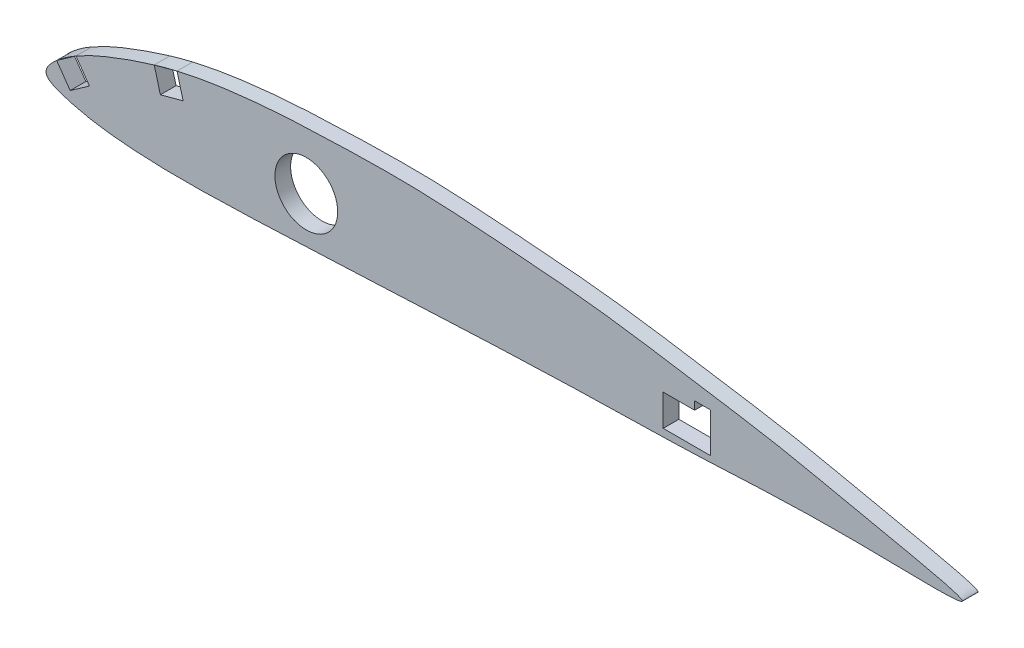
ISO-10303-21;
HEADER;
FILE_DESCRIPTION(('STEP AP214'),'2;1');
FILE_NAME('part.step','',(''),(''),'','','');
FILE_SCHEMA(('AUTOMOTIVE_DESIGN { 1 0 10303 214 1 1 1 1 }'));
ENDSEC;
DATA;
#1=APPLICATION_CONTEXT('core data for automotive mechanical design processes');
#2=APPLICATION_PROTOCOL_DEFINITION('international standard','automotive_design',2000,#1);
#3=PRODUCT_CONTEXT('',#1,'mechanical');
#4=PRODUCT('Part','Part','',(#3));
#5=PRODUCT_RELATED_PRODUCT_CATEGORY('part','',(#4));
#6=PRODUCT_DEFINITION_FORMATION('','',#4);
#7=PRODUCT_DEFINITION_CONTEXT('part definition',#1,'design');
#8=PRODUCT_DEFINITION('design','',#6,#7);
#9=PRODUCT_DEFINITION_SHAPE('','',#8);
#10=(LENGTH_UNIT() NAMED_UNIT(*) SI_UNIT(.MILLI.,.METRE.));
#11=(NAMED_UNIT(*) PLANE_ANGLE_UNIT() SI_UNIT($,.RADIAN.));
#12=(NAMED_UNIT(*) SI_UNIT($,.STERADIAN.) SOLID_ANGLE_UNIT());
#13=UNCERTAINTY_MEASURE_WITH_UNIT(LENGTH_MEASURE(1.E-05),#10,'distance_accuracy_value','');
#14=(GEOMETRIC_REPRESENTATION_CONTEXT(3) GLOBAL_UNCERTAINTY_ASSIGNED_CONTEXT((#13)) GLOBAL_UNIT_ASSIGNED_CONTEXT((#10,
#11,#12)) REPRESENTATION_CONTEXT('',''));
#15=CARTESIAN_POINT('',(0.,0.,0.));
#16=DIRECTION('',(0.,0.,1.));
#17=DIRECTION('',(1.,0.,0.));
#18=AXIS2_PLACEMENT_3D('',#15,#16,#17);
#19=CARTESIAN_POINT('',(0.,0.,0.));
#20=DIRECTION('',(0.,0.,-1.));
#21=DIRECTION('',(-1.,0.,0.));
#22=AXIS2_PLACEMENT_3D('',#19,#20,#21);
#23=PLANE('',#22);
#24=DIRECTION('',(0.,1.,0.));
#25=VECTOR('',#24,1.);
#26=CARTESIAN_POINT('',(131.132,0.,0.));
#27=LINE('',#26,#25);
#28=CARTESIAN_POINT('',(131.132,6.35,0.));
#29=VERTEX_POINT('',#28);
#30=CARTESIAN_POINT('',(131.132,8.,0.));
#31=VERTEX_POINT('',#30);
#32=EDGE_CURVE('E208',#29,#31,#27,.T.);
#33=ORIENTED_EDGE('',*,*,#32,.F.);
#34=DIRECTION('',(1.,0.,0.));
#35=VECTOR('',#34,1.);
#36=CARTESIAN_POINT('',(0.,6.35,0.));
#37=LINE('',#36,#35);
#38=CARTESIAN_POINT('',(124.782,6.35,0.));
#39=VERTEX_POINT('',#38);
#40=EDGE_CURVE('E156',#39,#29,#37,.T.);
#41=ORIENTED_EDGE('',*,*,#40,.F.);
#42=DIRECTION('',(0.,1.,0.));
#43=VECTOR('',#42,1.);
#44=CARTESIAN_POINT('',(124.782,0.,0.));
#45=LINE('',#44,#43);
#46=CARTESIAN_POINT('',(124.782,0.,0.));
#47=VERTEX_POINT('',#46);
#48=EDGE_CURVE('E143',#47,#39,#45,.T.);
#49=ORIENTED_EDGE('',*,*,#48,.F.);
#50=DIRECTION('',(-1.,0.,0.));
#51=VECTOR('',#50,1.);
#52=CARTESIAN_POINT('',(0.,0.,0.));
#53=LINE('',#52,#51);
#54=CARTESIAN_POINT('',(134.307,0.,0.));
#55=VERTEX_POINT('',#54);
#56=EDGE_CURVE('E231',#55,#47,#53,.T.);
#57=ORIENTED_EDGE('',*,*,#56,.F.);
#58=DIRECTION('',(0.,-1.,0.));
#59=VECTOR('',#58,1.);
#60=CARTESIAN_POINT('',(134.307,0.,0.));
#61=LINE('',#60,#59);
#62=CARTESIAN_POINT('',(134.307,8.,0.));
#63=VERTEX_POINT('',#62);
#64=EDGE_CURVE('E227',#63,#55,#61,.T.);
#65=ORIENTED_EDGE('',*,*,#64,.F.);
#66=DIRECTION('',(1.,0.,0.));
#67=VECTOR('',#66,1.);
#68=CARTESIAN_POINT('',(0.,8.,0.));
#69=LINE('',#68,#67);
#70=EDGE_CURVE('E164',#31,#63,#69,.T.);
#71=ORIENTED_EDGE('',*,*,#70,.F.);
#72=EDGE_LOOP('',(#33,#41,#49,#57,#65,#71));
#73=FACE_BOUND('',#72,.T.);
#74=DIRECTION('',(-0.573576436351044,0.819152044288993,0.));
#75=VECTOR('',#74,1.);
#76=CARTESIAN_POINT('',(2.90598321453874,2.0347913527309,0.));
#77=LINE('',#76,#75);
#78=CARTESIAN_POINT('',(4.88912991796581,-0.797435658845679,0.));
#79=VERTEX_POINT('',#78);
#80=CARTESIAN_POINT('',(2.15747213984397,3.10377595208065,0.));
#81=VERTEX_POINT('',#80);
#82=EDGE_CURVE('E170',#79,#81,#77,.T.);
#83=ORIENTED_EDGE('',*,*,#82,.F.);
#84=DIRECTION('',(-0.819152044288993,-0.573576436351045,0.));
#85=VECTOR('',#84,1.);
#86=CARTESIAN_POINT('',(1.98314670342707,-2.83222701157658,0.));
#87=LINE('',#86,#85);
#88=CARTESIAN_POINT('',(8.79034152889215,1.93422211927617,0.));
#89=VERTEX_POINT('',#88);
#90=EDGE_CURVE('E235',#89,#79,#87,.T.);
#91=ORIENTED_EDGE('',*,*,#90,.F.);
#92=DIRECTION('',(0.573576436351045,-0.819152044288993,0.));
#93=VECTOR('',#92,1.);
#94=CARTESIAN_POINT('',(6.80719482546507,4.76644913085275,0.));
#95=LINE('',#94,#93);
#96=CARTESIAN_POINT('',(6.0586837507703,5.8354337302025,0.));
#97=VERTEX_POINT('',#96);
#98=EDGE_CURVE('E245',#97,#89,#95,.T.);
#99=ORIENTED_EDGE('',*,*,#98,.F.);
#100=CARTESIAN_POINT('',(0.,0.,0.));
#101=CARTESIAN_POINT('',(-0.0510371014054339,0.99111435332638,0.));
#102=CARTESIAN_POINT('',(2.11317193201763,3.21598034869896,0.));
#103=CARTESIAN_POINT('',(5.18701691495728,5.41749188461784,0.));
#104=CARTESIAN_POINT('',(9.1709488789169,7.56280277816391,0.));
#105=CARTESIAN_POINT('',(16.8003247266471,10.6662158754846,0.));
#106=CARTESIAN_POINT('',(26.0552091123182,13.6190284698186,0.));
#107=CARTESIAN_POINT('',(37.0103739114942,15.3709529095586,0.));
#108=CARTESIAN_POINT('',(46.2955117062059,16.2975785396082,0.));
#109=CARTESIAN_POINT('',(58.6549387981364,16.8155629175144,0.));
#110=CARTESIAN_POINT('',(74.1197721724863,17.2541897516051,0.));
#111=CARTESIAN_POINT('',(92.6289873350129,15.9551342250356,0.));
#112=CARTESIAN_POINT('',(111.271837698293,14.5024851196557,0.));
#113=CARTESIAN_POINT('',(129.491666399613,11.5838077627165,0.));
#114=CARTESIAN_POINT('',(149.036614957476,8.59586396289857,0.));
#115=CARTESIAN_POINT('',(163.952601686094,5.08680195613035,0.));
#116=CARTESIAN_POINT('',(195.703926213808,-1.20255975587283,0.));
#117=CARTESIAN_POINT('',(154.620961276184,0.244480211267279,0.));
#118=CARTESIAN_POINT('',(136.754951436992,-1.39054378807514,0.));
#119=CARTESIAN_POINT('',(98.1870529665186,-1.99852366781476,0.));
#120=CARTESIAN_POINT('',(68.0386567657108,-3.64127589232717,0.));
#121=CARTESIAN_POINT('',(36.9982035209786,-4.99429997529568,0.));
#122=CARTESIAN_POINT('',(21.7434792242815,-5.24443451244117,0.));
#123=CARTESIAN_POINT('',(10.5152616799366,-4.15694764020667,0.));
#124=CARTESIAN_POINT('',(4.79914448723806,-2.84996151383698,0.));
#125=CARTESIAN_POINT('',(0.0700361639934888,-1.36006641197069,0.));
#126=CARTESIAN_POINT('',(0.,0.,0.));
#127=B_SPLINE_CURVE_WITH_KNOTS('',3,(#100,#101,#102,#103,#104,#105,#106,#107,#108,#109,#110,
#111,#112,#113,#114,#115,#116,#117,#118,#119,#120,#121,#122,#123,#124,#125,#126),.UNSPECIFIED.,
.T.,.F.,(4,1,1,1,1,1,1,1,1,1,1,1,1,1,1,1,1,1,1,1,1,1,1,1,4),(0.,0.0105604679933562,
0.0182111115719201,0.0322098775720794,0.0455249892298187,0.0840694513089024,0.10897429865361,
0.133649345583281,0.158232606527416,0.207343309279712,0.25652270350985,0.30582635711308,
0.355445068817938,0.40521420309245,0.4553904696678,0.506006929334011,0.555121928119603,
0.653369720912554,0.702490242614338,0.849938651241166,0.899083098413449,0.948194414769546,
0.972905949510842,0.985508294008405,1.),.UNSPECIFIED.);
#128=CARTESIAN_POINT('',(21.8877922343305,12.1770810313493,0.));
#129=VERTEX_POINT('',#128);
#130=EDGE_CURVE('E183',#97,#129,#127,.T.);
#131=ORIENTED_EDGE('',*,*,#130,.T.);
#132=DIRECTION('',(-0.258819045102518,0.965925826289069,0.));
#133=VECTOR('',#132,1.);
#134=CARTESIAN_POINT('',(23.4658584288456,6.28765781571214,0.));
#135=LINE('',#134,#133);
#136=CARTESIAN_POINT('',(23.1204179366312,7.57685928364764,0.));
#137=VERTEX_POINT('',#136);
#138=EDGE_CURVE('E219',#137,#129,#135,.T.);
#139=ORIENTED_EDGE('',*,*,#138,.F.);
#140=DIRECTION('',(-0.965925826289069,-0.258819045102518,0.));
#141=VECTOR('',#140,1.);
#142=CARTESIAN_POINT('',(-0.345440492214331,1.2892014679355,0.));
#143=LINE('',#142,#141);
#144=CARTESIAN_POINT('',(27.7206396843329,8.80948498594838,0.));
#145=VERTEX_POINT('',#144);
#146=EDGE_CURVE('E239',#145,#137,#143,.T.);
#147=ORIENTED_EDGE('',*,*,#146,.F.);
#148=DIRECTION('',(0.258819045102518,-0.965925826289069,0.));
#149=VECTOR('',#148,1.);
#150=CARTESIAN_POINT('',(28.0660801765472,7.52028351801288,0.));
#151=LINE('',#150,#149);
#152=CARTESIAN_POINT('',(26.4880139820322,13.4097067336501,0.));
#153=VERTEX_POINT('',#152);
#154=EDGE_CURVE('E249',#153,#145,#151,.T.);
#155=ORIENTED_EDGE('',*,*,#154,.F.);
#156=EDGE_CURVE('E176',#153,#81,#127,.T.);
#157=ORIENTED_EDGE('',*,*,#156,.T.);
#158=EDGE_LOOP('',(#83,#91,#99,#131,#139,#147,#155,#157));
#159=FACE_BOUND('',#158,.T.);
#160=CARTESIAN_POINT('',(52.625,4.99999999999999,0.));
#161=DIRECTION('',(0.,0.,-1.));
#162=DIRECTION('',(-1.,0.,0.));
#163=AXIS2_PLACEMENT_3D('',#160,#161,#162);
#164=CIRCLE('',#163,6.35);
#165=CARTESIAN_POINT('',(46.275,4.99999999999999,0.));
#166=VERTEX_POINT('',#165);
#167=EDGE_CURVE('E214',#166,#166,#164,.T.);
#168=ORIENTED_EDGE('',*,*,#167,.F.);
#169=EDGE_LOOP('',(#168));
#170=FACE_BOUND('',#169,.T.);
#171=ADVANCED_FACE('F44',(#73,#159,#170),#23,.T.);
#172=CARTESIAN_POINT('',(0.,0.,3.175));
#173=DIRECTION('',(0.,0.,-1.));
#174=DIRECTION('',(-1.,0.,0.));
#175=AXIS2_PLACEMENT_3D('',#172,#173,#174);
#176=PLANE('',#175);
#177=DIRECTION('',(-1.,0.,0.));
#178=VECTOR('',#177,1.);
#179=CARTESIAN_POINT('',(124.782,6.35,3.175));
#180=LINE('',#179,#178);
#181=CARTESIAN_POINT('',(131.132,6.35,3.175));
#182=VERTEX_POINT('',#181);
#183=CARTESIAN_POINT('',(124.782,6.35,3.175));
#184=VERTEX_POINT('',#183);
#185=EDGE_CURVE('E13',#182,#184,#180,.T.);
#186=ORIENTED_EDGE('',*,*,#185,.F.);
#187=DIRECTION('',(0.,-1.,0.));
#188=VECTOR('',#187,1.);
#189=CARTESIAN_POINT('',(131.132,8.,3.175));
#190=LINE('',#189,#188);
#191=CARTESIAN_POINT('',(131.132,8.,3.175));
#192=VERTEX_POINT('',#191);
#193=EDGE_CURVE('E162',#192,#182,#190,.T.);
#194=ORIENTED_EDGE('',*,*,#193,.F.);
#195=DIRECTION('',(-1.,0.,0.));
#196=VECTOR('',#195,1.);
#197=CARTESIAN_POINT('',(131.132,8.,3.175));
#198=LINE('',#197,#196);
#199=CARTESIAN_POINT('',(134.307,8.,3.175));
#200=VERTEX_POINT('',#199);
#201=EDGE_CURVE('E230',#200,#192,#198,.T.);
#202=ORIENTED_EDGE('',*,*,#201,.F.);
#203=DIRECTION('',(0.,1.,0.));
#204=VECTOR('',#203,1.);
#205=CARTESIAN_POINT('',(134.307,8.,3.175));
#206=LINE('',#205,#204);
#207=CARTESIAN_POINT('',(134.307,0.,3.175));
#208=VERTEX_POINT('',#207);
#209=EDGE_CURVE('E233',#208,#200,#206,.T.);
#210=ORIENTED_EDGE('',*,*,#209,.F.);
#211=DIRECTION('',(1.,0.,0.));
#212=VECTOR('',#211,1.);
#213=CARTESIAN_POINT('',(131.132,0.,3.175));
#214=LINE('',#213,#212);
#215=CARTESIAN_POINT('',(124.782,0.,3.175));
#216=VERTEX_POINT('',#215);
#217=EDGE_CURVE('E155',#216,#208,#214,.T.);
#218=ORIENTED_EDGE('',*,*,#217,.F.);
#219=DIRECTION('',(0.,-1.,0.));
#220=VECTOR('',#219,1.);
#221=CARTESIAN_POINT('',(124.782,6.35,3.175));
#222=LINE('',#221,#220);
#223=EDGE_CURVE('E140',#184,#216,#222,.T.);
#224=ORIENTED_EDGE('',*,*,#223,.F.);
#225=EDGE_LOOP('',(#186,#194,#202,#210,#218,#224));
#226=FACE_BOUND('',#225,.T.);
#227=CARTESIAN_POINT('',(52.625,4.99999999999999,3.175));
#228=DIRECTION('',(0.,0.,1.));
#229=DIRECTION('',(1.,0.,0.));
#230=AXIS2_PLACEMENT_3D('',#227,#228,#229);
#231=CIRCLE('',#230,6.35);
#232=CARTESIAN_POINT('',(58.975,4.99999999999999,3.175));
#233=VERTEX_POINT('',#232);
#234=EDGE_CURVE('E216',#233,#233,#231,.T.);
#235=ORIENTED_EDGE('',*,*,#234,.F.);
#236=EDGE_LOOP('',(#235));
#237=FACE_BOUND('',#236,.T.);
#238=DIRECTION('',(0.819152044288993,0.573576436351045,0.));
#239=VECTOR('',#238,1.);
#240=CARTESIAN_POINT('',(4.88912991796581,-0.797435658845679,3.175));
#241=LINE('',#240,#239);
#242=CARTESIAN_POINT('',(4.88912991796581,-0.797435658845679,3.175));
#243=VERTEX_POINT('',#242);
#244=CARTESIAN_POINT('',(8.79034152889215,1.93422211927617,3.175));
#245=VERTEX_POINT('',#244);
#246=EDGE_CURVE('E224',#243,#245,#241,.T.);
#247=ORIENTED_EDGE('',*,*,#246,.F.);
#248=DIRECTION('',(0.573576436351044,-0.819152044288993,0.));
#249=VECTOR('',#248,1.);
#250=CARTESIAN_POINT('',(2.15747213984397,3.10377595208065,3.175));
#251=LINE('',#250,#249);
#252=CARTESIAN_POINT('',(2.15747213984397,3.10377595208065,3.175));
#253=VERTEX_POINT('',#252);
#254=EDGE_CURVE('E169',#253,#243,#251,.T.);
#255=ORIENTED_EDGE('',*,*,#254,.F.);
#256=CARTESIAN_POINT('',(0.,0.,3.175));
#257=CARTESIAN_POINT('',(-0.0510371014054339,0.99111435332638,3.175));
#258=CARTESIAN_POINT('',(2.11317193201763,3.21598034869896,3.175));
#259=CARTESIAN_POINT('',(5.18701691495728,5.41749188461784,3.175));
#260=CARTESIAN_POINT('',(9.1709488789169,7.56280277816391,3.175));
#261=CARTESIAN_POINT('',(16.8003247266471,10.6662158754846,3.175));
#262=CARTESIAN_POINT('',(26.0552091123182,13.6190284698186,3.175));
#263=CARTESIAN_POINT('',(37.0103739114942,15.3709529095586,3.175));
#264=CARTESIAN_POINT('',(46.2955117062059,16.2975785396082,3.175));
#265=CARTESIAN_POINT('',(58.6549387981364,16.8155629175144,3.175));
#266=CARTESIAN_POINT('',(74.1197721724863,17.2541897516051,3.175));
#267=CARTESIAN_POINT('',(92.6289873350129,15.9551342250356,3.175));
#268=CARTESIAN_POINT('',(111.271837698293,14.5024851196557,3.175));
#269=CARTESIAN_POINT('',(129.491666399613,11.5838077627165,3.175));
#270=CARTESIAN_POINT('',(149.036614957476,8.59586396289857,3.175));
#271=CARTESIAN_POINT('',(163.952601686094,5.08680195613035,3.175));
#272=CARTESIAN_POINT('',(195.703926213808,-1.20255975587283,3.175));
#273=CARTESIAN_POINT('',(154.620961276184,0.244480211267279,3.175));
#274=CARTESIAN_POINT('',(136.754951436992,-1.39054378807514,3.175));
#275=CARTESIAN_POINT('',(98.1870529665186,-1.99852366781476,3.175));
#276=CARTESIAN_POINT('',(68.0386567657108,-3.64127589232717,3.175));
#277=CARTESIAN_POINT('',(36.9982035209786,-4.99429997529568,3.175));
#278=CARTESIAN_POINT('',(21.7434792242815,-5.24443451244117,3.175));
#279=CARTESIAN_POINT('',(10.5152616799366,-4.15694764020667,3.175));
#280=CARTESIAN_POINT('',(4.79914448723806,-2.84996151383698,3.175));
#281=CARTESIAN_POINT('',(0.0700361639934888,-1.36006641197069,3.175));
#282=CARTESIAN_POINT('',(0.,0.,3.175));
#283=B_SPLINE_CURVE_WITH_KNOTS('',3,(#256,#257,#258,#259,#260,#261,#262,#263,#264,#265,#266,
#267,#268,#269,#270,#271,#272,#273,#274,#275,#276,#277,#278,#279,#280,#281,#282),.UNSPECIFIED.,
.T.,.F.,(4,1,1,1,1,1,1,1,1,1,1,1,1,1,1,1,1,1,1,1,1,1,1,1,4),(0.,0.0105604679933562,
0.0182111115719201,0.0322098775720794,0.0455249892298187,0.0840694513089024,0.10897429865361,
0.133649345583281,0.158232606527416,0.207343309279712,0.25652270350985,0.30582635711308,
0.355445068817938,0.40521420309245,0.4553904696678,0.506006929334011,0.555121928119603,
0.653369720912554,0.702490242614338,0.849938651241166,0.899083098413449,0.948194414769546,
0.972905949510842,0.985508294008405,1.),.UNSPECIFIED.);
#284=CARTESIAN_POINT('',(26.4880139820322,13.4097067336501,3.175));
#285=VERTEX_POINT('',#284);
#286=EDGE_CURVE('E175',#285,#253,#283,.T.);
#287=ORIENTED_EDGE('',*,*,#286,.F.);
#288=DIRECTION('',(-0.258819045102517,0.965925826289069,0.));
#289=VECTOR('',#288,1.);
#290=CARTESIAN_POINT('',(26.4880139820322,13.4097067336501,3.175));
#291=LINE('',#290,#289);
#292=CARTESIAN_POINT('',(27.7206396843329,8.80948498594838,3.175));
#293=VERTEX_POINT('',#292);
#294=EDGE_CURVE('E242',#293,#285,#291,.T.);
#295=ORIENTED_EDGE('',*,*,#294,.F.);
#296=DIRECTION('',(0.965925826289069,0.258819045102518,0.));
#297=VECTOR('',#296,1.);
#298=CARTESIAN_POINT('',(23.1204179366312,7.57685928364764,3.175));
#299=LINE('',#298,#297);
#300=CARTESIAN_POINT('',(23.1204179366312,7.57685928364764,3.175));
#301=VERTEX_POINT('',#300);
#302=EDGE_CURVE('E244',#301,#293,#299,.T.);
#303=ORIENTED_EDGE('',*,*,#302,.F.);
#304=DIRECTION('',(0.258819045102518,-0.965925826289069,0.));
#305=VECTOR('',#304,1.);
#306=CARTESIAN_POINT('',(21.8877922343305,12.1770810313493,3.175));
#307=LINE('',#306,#305);
#308=CARTESIAN_POINT('',(21.8877922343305,12.1770810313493,3.175));
#309=VERTEX_POINT('',#308);
#310=EDGE_CURVE('E252',#309,#301,#307,.T.);
#311=ORIENTED_EDGE('',*,*,#310,.F.);
#312=CARTESIAN_POINT('',(6.0586837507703,5.8354337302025,3.175));
#313=VERTEX_POINT('',#312);
#314=EDGE_CURVE('E174',#313,#309,#283,.T.);
#315=ORIENTED_EDGE('',*,*,#314,.F.);
#316=DIRECTION('',(-0.573576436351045,0.819152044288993,0.));
#317=VECTOR('',#316,1.);
#318=CARTESIAN_POINT('',(6.0586837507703,5.8354337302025,3.175));
#319=LINE('',#318,#317);
#320=EDGE_CURVE('E238',#245,#313,#319,.T.);
#321=ORIENTED_EDGE('',*,*,#320,.F.);
#322=EDGE_LOOP('',(#247,#255,#287,#295,#303,#311,#315,#321));
#323=FACE_BOUND('',#322,.T.);
#324=ADVANCED_FACE('F152',(#226,#237,#323),#176,.F.);
#325=DIRECTION('',(0.,0.,1.));
#326=VECTOR('',#325,1.);
#327=SURFACE_OF_LINEAR_EXTRUSION('',#127,#326);
#328=DIRECTION('',(0.,0.,1.));
#329=VECTOR('',#328,1.);
#330=CARTESIAN_POINT('',(2.1574721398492,3.10377595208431,0.));
#331=LINE('',#330,#329);
#332=EDGE_CURVE('E166',#81,#253,#331,.T.);
#333=ORIENTED_EDGE('',*,*,#332,.F.);
#334=ORIENTED_EDGE('',*,*,#156,.F.);
#335=DIRECTION('',(0.,0.,1.));
#336=VECTOR('',#335,1.);
#337=CARTESIAN_POINT('',(26.4880139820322,13.4097067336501,0.));
#338=LINE('',#337,#336);
#339=EDGE_CURVE('E182',#153,#285,#338,.T.);
#340=ORIENTED_EDGE('',*,*,#339,.T.);
#341=ORIENTED_EDGE('',*,*,#286,.T.);
#342=EDGE_LOOP('',(#333,#334,#340,#341));
#343=FACE_BOUND('',#342,.T.);
#344=ADVANCED_FACE('F192',(#343),#327,.F.);
#345=ORIENTED_EDGE('',*,*,#130,.F.);
#346=DIRECTION('',(0.,0.,1.));
#347=VECTOR('',#346,1.);
#348=CARTESIAN_POINT('',(6.05868375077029,5.8354337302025,0.));
#349=LINE('',#348,#347);
#350=EDGE_CURVE('E171',#97,#313,#349,.T.);
#351=ORIENTED_EDGE('',*,*,#350,.T.);
#352=ORIENTED_EDGE('',*,*,#314,.T.);
#353=DIRECTION('',(0.,0.,1.));
#354=VECTOR('',#353,1.);
#355=CARTESIAN_POINT('',(21.8877922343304,12.1770810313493,0.));
#356=LINE('',#355,#354);
#357=EDGE_CURVE('E47',#129,#309,#356,.T.);
#358=ORIENTED_EDGE('',*,*,#357,.F.);
#359=EDGE_LOOP('',(#345,#351,#352,#358));
#360=FACE_BOUND('',#359,.T.);
#361=ADVANCED_FACE('F188',(#360),#327,.F.);
#362=CARTESIAN_POINT('',(52.625,4.99999999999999,-6.825));
#363=DIRECTION('',(0.,0.,1.));
#364=DIRECTION('',(1.,0.,0.));
#365=AXIS2_PLACEMENT_3D('',#362,#363,#364);
#366=CYLINDRICAL_SURFACE('',#365,6.35);
#367=ORIENTED_EDGE('',*,*,#167,.T.);
#368=EDGE_LOOP('',(#367));
#369=FACE_BOUND('',#368,.T.);
#370=ORIENTED_EDGE('',*,*,#234,.T.);
#371=EDGE_LOOP('',(#370));
#372=FACE_BOUND('',#371,.T.);
#373=ADVANCED_FACE('F191',(#369,#372),#366,.F.);
#374=CARTESIAN_POINT('',(21.8877922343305,12.1770810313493,-6.825));
#375=DIRECTION('',(-0.965925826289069,-0.258819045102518,0.));
#376=DIRECTION('',(0.258819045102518,-0.965925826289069,0.));
#377=AXIS2_PLACEMENT_3D('',#374,#375,#376);
#378=PLANE('',#377);
#379=ORIENTED_EDGE('',*,*,#138,.T.);
#380=ORIENTED_EDGE('',*,*,#357,.T.);
#381=ORIENTED_EDGE('',*,*,#310,.T.);
#382=DIRECTION('',(0.,0.,1.));
#383=VECTOR('',#382,1.);
#384=CARTESIAN_POINT('',(23.1204179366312,7.57685928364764,-6.825));
#385=LINE('',#384,#383);
#386=EDGE_CURVE('E241',#137,#301,#385,.T.);
#387=ORIENTED_EDGE('',*,*,#386,.F.);
#388=EDGE_LOOP('',(#379,#380,#381,#387));
#389=FACE_BOUND('',#388,.T.);
#390=ADVANCED_FACE('F378',(#389),#378,.F.);
#391=CARTESIAN_POINT('',(26.4880139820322,13.4097067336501,-6.825));
#392=DIRECTION('',(0.965925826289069,0.258819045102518,0.));
#393=DIRECTION('',(-0.258819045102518,0.965925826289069,0.));
#394=AXIS2_PLACEMENT_3D('',#391,#392,#393);
#395=PLANE('',#394);
#396=ORIENTED_EDGE('',*,*,#154,.T.);
#397=DIRECTION('',(0.,0.,1.));
#398=VECTOR('',#397,1.);
#399=CARTESIAN_POINT('',(27.7206396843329,8.80948498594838,-6.825));
#400=LINE('',#399,#398);
#401=EDGE_CURVE('E251',#145,#293,#400,.T.);
#402=ORIENTED_EDGE('',*,*,#401,.T.);
#403=ORIENTED_EDGE('',*,*,#294,.T.);
#404=ORIENTED_EDGE('',*,*,#339,.F.);
#405=EDGE_LOOP('',(#396,#402,#403,#404));
#406=FACE_BOUND('',#405,.T.);
#407=ADVANCED_FACE('F369',(#406),#395,.F.);
#408=CARTESIAN_POINT('',(23.1204179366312,7.57685928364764,-6.825));
#409=DIRECTION('',(0.258819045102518,-0.965925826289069,0.));
#410=DIRECTION('',(0.965925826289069,0.258819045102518,0.));
#411=AXIS2_PLACEMENT_3D('',#408,#409,#410);
#412=PLANE('',#411);
#413=ORIENTED_EDGE('',*,*,#146,.T.);
#414=ORIENTED_EDGE('',*,*,#386,.T.);
#415=ORIENTED_EDGE('',*,*,#302,.T.);
#416=ORIENTED_EDGE('',*,*,#401,.F.);
#417=EDGE_LOOP('',(#413,#414,#415,#416));
#418=FACE_BOUND('',#417,.T.);
#419=ADVANCED_FACE('F360',(#418),#412,.F.);
#420=CARTESIAN_POINT('',(2.15747213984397,3.10377595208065,-6.825));
#421=DIRECTION('',(-0.819152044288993,-0.573576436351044,0.));
#422=DIRECTION('',(0.573576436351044,-0.819152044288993,0.));
#423=AXIS2_PLACEMENT_3D('',#420,#421,#422);
#424=PLANE('',#423);
#425=ORIENTED_EDGE('',*,*,#82,.T.);
#426=ORIENTED_EDGE('',*,*,#332,.T.);
#427=ORIENTED_EDGE('',*,*,#254,.T.);
#428=DIRECTION('',(0.,0.,1.));
#429=VECTOR('',#428,1.);
#430=CARTESIAN_POINT('',(4.88912991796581,-0.797435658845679,-6.825));
#431=LINE('',#430,#429);
#432=EDGE_CURVE('E237',#79,#243,#431,.T.);
#433=ORIENTED_EDGE('',*,*,#432,.F.);
#434=EDGE_LOOP('',(#425,#426,#427,#433));
#435=FACE_BOUND('',#434,.T.);
#436=ADVANCED_FACE('F352',(#435),#424,.F.);
#437=CARTESIAN_POINT('',(6.0586837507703,5.8354337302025,-6.825));
#438=DIRECTION('',(0.819152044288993,0.573576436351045,0.));
#439=DIRECTION('',(-0.573576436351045,0.819152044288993,0.));
#440=AXIS2_PLACEMENT_3D('',#437,#438,#439);
#441=PLANE('',#440);
#442=ORIENTED_EDGE('',*,*,#98,.T.);
#443=DIRECTION('',(0.,0.,1.));
#444=VECTOR('',#443,1.);
#445=CARTESIAN_POINT('',(8.79034152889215,1.93422211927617,-6.825));
#446=LINE('',#445,#444);
#447=EDGE_CURVE('E247',#89,#245,#446,.T.);
#448=ORIENTED_EDGE('',*,*,#447,.T.);
#449=ORIENTED_EDGE('',*,*,#320,.T.);
#450=ORIENTED_EDGE('',*,*,#350,.F.);
#451=EDGE_LOOP('',(#442,#448,#449,#450));
#452=FACE_BOUND('',#451,.T.);
#453=ADVANCED_FACE('F293',(#452),#441,.F.);
#454=CARTESIAN_POINT('',(4.88912991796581,-0.797435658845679,-6.825));
#455=DIRECTION('',(0.573576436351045,-0.819152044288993,0.));
#456=DIRECTION('',(0.819152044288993,0.573576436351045,0.));
#457=AXIS2_PLACEMENT_3D('',#454,#455,#456);
#458=PLANE('',#457);
#459=ORIENTED_EDGE('',*,*,#90,.T.);
#460=ORIENTED_EDGE('',*,*,#432,.T.);
#461=ORIENTED_EDGE('',*,*,#246,.T.);
#462=ORIENTED_EDGE('',*,*,#447,.F.);
#463=EDGE_LOOP('',(#459,#460,#461,#462));
#464=FACE_BOUND('',#463,.T.);
#465=ADVANCED_FACE('F287',(#464),#458,.F.);
#466=CARTESIAN_POINT('',(131.132,8.,-6.825));
#467=DIRECTION('',(-1.,0.,0.));
#468=DIRECTION('',(0.,0.,1.));
#469=AXIS2_PLACEMENT_3D('',#466,#467,#468);
#470=PLANE('',#469);
#471=ORIENTED_EDGE('',*,*,#32,.T.);
#472=DIRECTION('',(0.,0.,1.));
#473=VECTOR('',#472,1.);
#474=CARTESIAN_POINT('',(131.132,8.,-6.825));
#475=LINE('',#474,#473);
#476=EDGE_CURVE('E165',#31,#192,#475,.T.);
#477=ORIENTED_EDGE('',*,*,#476,.T.);
#478=ORIENTED_EDGE('',*,*,#193,.T.);
#479=DIRECTION('',(0.,0.,1.));
#480=VECTOR('',#479,1.);
#481=CARTESIAN_POINT('',(131.132,6.35,-6.825));
#482=LINE('',#481,#480);
#483=EDGE_CURVE('E53',#29,#182,#482,.T.);
#484=ORIENTED_EDGE('',*,*,#483,.F.);
#485=EDGE_LOOP('',(#471,#477,#478,#484));
#486=FACE_BOUND('',#485,.T.);
#487=ADVANCED_FACE('F285',(#486),#470,.F.);
#488=CARTESIAN_POINT('',(131.132,8.,-6.825));
#489=DIRECTION('',(0.,1.,0.));
#490=DIRECTION('',(0.,0.,1.));
#491=AXIS2_PLACEMENT_3D('',#488,#489,#490);
#492=PLANE('',#491);
#493=ORIENTED_EDGE('',*,*,#70,.T.);
#494=DIRECTION('',(0.,0.,1.));
#495=VECTOR('',#494,1.);
#496=CARTESIAN_POINT('',(134.307,8.,-6.825));
#497=LINE('',#496,#495);
#498=EDGE_CURVE('E226',#63,#200,#497,.T.);
#499=ORIENTED_EDGE('',*,*,#498,.T.);
#500=ORIENTED_EDGE('',*,*,#201,.T.);
#501=ORIENTED_EDGE('',*,*,#476,.F.);
#502=EDGE_LOOP('',(#493,#499,#500,#501));
#503=FACE_BOUND('',#502,.T.);
#504=ADVANCED_FACE('F194',(#503),#492,.F.);
#505=CARTESIAN_POINT('',(134.307,8.,-6.825));
#506=DIRECTION('',(1.,0.,0.));
#507=DIRECTION('',(0.,0.,-1.));
#508=AXIS2_PLACEMENT_3D('',#505,#506,#507);
#509=PLANE('',#508);
#510=ORIENTED_EDGE('',*,*,#64,.T.);
#511=DIRECTION('',(0.,0.,1.));
#512=VECTOR('',#511,1.);
#513=CARTESIAN_POINT('',(134.307,0.,-6.825));
#514=LINE('',#513,#512);
#515=EDGE_CURVE('E229',#55,#208,#514,.T.);
#516=ORIENTED_EDGE('',*,*,#515,.T.);
#517=ORIENTED_EDGE('',*,*,#209,.T.);
#518=ORIENTED_EDGE('',*,*,#498,.F.);
#519=EDGE_LOOP('',(#510,#516,#517,#518));
#520=FACE_BOUND('',#519,.T.);
#521=ADVANCED_FACE('F277',(#520),#509,.F.);
#522=CARTESIAN_POINT('',(131.132,0.,-6.825));
#523=DIRECTION('',(0.,-1.,0.));
#524=DIRECTION('',(0.,0.,-1.));
#525=AXIS2_PLACEMENT_3D('',#522,#523,#524);
#526=PLANE('',#525);
#527=ORIENTED_EDGE('',*,*,#56,.T.);
#528=DIRECTION('',(0.,0.,1.));
#529=VECTOR('',#528,1.);
#530=CARTESIAN_POINT('',(124.782,0.,-6.825));
#531=LINE('',#530,#529);
#532=EDGE_CURVE('E135',#47,#216,#531,.T.);
#533=ORIENTED_EDGE('',*,*,#532,.T.);
#534=ORIENTED_EDGE('',*,*,#217,.T.);
#535=ORIENTED_EDGE('',*,*,#515,.F.);
#536=EDGE_LOOP('',(#527,#533,#534,#535));
#537=FACE_BOUND('',#536,.T.);
#538=ADVANCED_FACE('F283',(#537),#526,.F.);
#539=CARTESIAN_POINT('',(124.782,6.35,-6.825));
#540=DIRECTION('',(-1.,0.,0.));
#541=DIRECTION('',(0.,0.,1.));
#542=AXIS2_PLACEMENT_3D('',#539,#540,#541);
#543=PLANE('',#542);
#544=ORIENTED_EDGE('',*,*,#48,.T.);
#545=DIRECTION('',(0.,0.,1.));
#546=VECTOR('',#545,1.);
#547=CARTESIAN_POINT('',(124.782,6.35,-6.825));
#548=LINE('',#547,#546);
#549=EDGE_CURVE('E61',#39,#184,#548,.T.);
#550=ORIENTED_EDGE('',*,*,#549,.T.);
#551=ORIENTED_EDGE('',*,*,#223,.T.);
#552=ORIENTED_EDGE('',*,*,#532,.F.);
#553=EDGE_LOOP('',(#544,#550,#551,#552));
#554=FACE_BOUND('',#553,.T.);
#555=ADVANCED_FACE('F138',(#554),#543,.F.);
#556=CARTESIAN_POINT('',(124.782,6.35,-6.825));
#557=DIRECTION('',(0.,1.,0.));
#558=DIRECTION('',(0.,0.,1.));
#559=AXIS2_PLACEMENT_3D('',#556,#557,#558);
#560=PLANE('',#559);
#561=ORIENTED_EDGE('',*,*,#40,.T.);
#562=ORIENTED_EDGE('',*,*,#483,.T.);
#563=ORIENTED_EDGE('',*,*,#185,.T.);
#564=ORIENTED_EDGE('',*,*,#549,.F.);
#565=EDGE_LOOP('',(#561,#562,#563,#564));
#566=FACE_BOUND('',#565,.T.);
#567=ADVANCED_FACE('F148',(#566),#560,.F.);
#568=CLOSED_SHELL('',(#171,#324,#344,#361,#373,#390,#407,#419,#436,#453,#465,#487,#504,#521,
#538,#555,#567));
#569=MANIFOLD_SOLID_BREP('B2',#568);
#570=CARTESIAN_POINT('',(0.,0.,0.));
#571=CARTESIAN_POINT('',(-0.0510371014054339,0.99111435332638,0.));
#572=CARTESIAN_POINT('',(2.11317193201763,3.21598034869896,0.));
#573=CARTESIAN_POINT('',(5.18701691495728,5.41749188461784,0.));
#574=CARTESIAN_POINT('',(9.1709488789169,7.56280277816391,0.));
#575=CARTESIAN_POINT('',(16.8003247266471,10.6662158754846,0.));
#576=CARTESIAN_POINT('',(26.0552091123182,13.6190284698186,0.));
#577=CARTESIAN_POINT('',(37.0103739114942,15.3709529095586,0.));
#578=CARTESIAN_POINT('',(46.2955117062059,16.2975785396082,0.));
#579=CARTESIAN_POINT('',(58.6549387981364,16.8155629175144,0.));
#580=CARTESIAN_POINT('',(74.1197721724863,17.2541897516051,0.));
#581=CARTESIAN_POINT('',(92.6289873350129,15.9551342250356,0.));
#582=CARTESIAN_POINT('',(111.271837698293,14.5024851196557,0.));
#583=CARTESIAN_POINT('',(129.491666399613,11.5838077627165,0.));
#584=CARTESIAN_POINT('',(149.036614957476,8.59586396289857,0.));
#585=CARTESIAN_POINT('',(163.952601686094,5.08680195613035,0.));
#586=CARTESIAN_POINT('',(195.703926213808,-1.20255975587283,0.));
#587=CARTESIAN_POINT('',(154.620961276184,0.244480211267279,0.));
#588=CARTESIAN_POINT('',(136.754951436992,-1.39054378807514,0.));
#589=CARTESIAN_POINT('',(98.1870529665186,-1.99852366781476,0.));
#590=CARTESIAN_POINT('',(68.0386567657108,-3.64127589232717,0.));
#591=CARTESIAN_POINT('',(36.9982035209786,-4.99429997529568,0.));
#592=CARTESIAN_POINT('',(21.7434792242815,-5.24443451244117,0.));
#593=CARTESIAN_POINT('',(10.5152616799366,-4.15694764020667,0.));
#594=CARTESIAN_POINT('',(4.79914448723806,-2.84996151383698,0.));
#595=CARTESIAN_POINT('',(0.0700361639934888,-1.36006641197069,0.));
#596=CARTESIAN_POINT('',(0.,0.,0.));
#597=B_SPLINE_CURVE_WITH_KNOTS('',3,(#570,#571,#572,#573,#574,#575,#576,#577,#578,#579,#580,
#581,#582,#583,#584,#585,#586,#587,#588,#589,#590,#591,#592,#593,#594,#595,#596),.UNSPECIFIED.,
.T.,.F.,(4,1,1,1,1,1,1,1,1,1,1,1,1,1,1,1,1,1,1,1,1,1,1,1,4),(0.,0.0105604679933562,
0.0182111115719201,0.0322098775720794,0.0455249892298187,0.0840694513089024,0.10897429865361,
0.133649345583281,0.158232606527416,0.207343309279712,0.25652270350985,0.30582635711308,
0.355445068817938,0.40521420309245,0.4553904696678,0.506006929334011,0.555121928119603,
0.653369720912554,0.702490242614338,0.849938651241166,0.899083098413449,0.948194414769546,
0.972905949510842,0.985508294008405,1.),.UNSPECIFIED.);
#598=DIRECTION('',(0.,0.,1.));
#599=VECTOR('',#598,1.);
#600=SURFACE_OF_LINEAR_EXTRUSION('',#597,#599);
#601=CARTESIAN_POINT('',(21.8877922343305,12.1770810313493,0.));
#602=VERTEX_POINT('',#601);
#603=CARTESIAN_POINT('',(26.4880139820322,13.4097067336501,0.));
#604=VERTEX_POINT('',#603);
#605=EDGE_CURVE('E502',#602,#604,#597,.T.);
#606=ORIENTED_EDGE('',*,*,#605,.F.);
#607=DIRECTION('',(0.,0.,1.));
#608=VECTOR('',#607,1.);
#609=CARTESIAN_POINT('',(21.8877922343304,12.1770810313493,0.));
#610=LINE('',#609,#608);
#611=CARTESIAN_POINT('',(21.8877922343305,12.1770810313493,3.175));
#612=VERTEX_POINT('',#611);
#613=EDGE_CURVE('E489',#602,#612,#610,.T.);
#614=ORIENTED_EDGE('',*,*,#613,.T.);
#615=CARTESIAN_POINT('',(0.,0.,3.175));
#616=CARTESIAN_POINT('',(-0.0510371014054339,0.99111435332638,3.175));
#617=CARTESIAN_POINT('',(2.11317193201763,3.21598034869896,3.175));
#618=CARTESIAN_POINT('',(5.18701691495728,5.41749188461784,3.175));
#619=CARTESIAN_POINT('',(9.1709488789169,7.56280277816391,3.175));
#620=CARTESIAN_POINT('',(16.8003247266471,10.6662158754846,3.175));
#621=CARTESIAN_POINT('',(26.0552091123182,13.6190284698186,3.175));
#622=CARTESIAN_POINT('',(37.0103739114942,15.3709529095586,3.175));
#623=CARTESIAN_POINT('',(46.2955117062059,16.2975785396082,3.175));
#624=CARTESIAN_POINT('',(58.6549387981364,16.8155629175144,3.175));
#625=CARTESIAN_POINT('',(74.1197721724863,17.2541897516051,3.175));
#626=CARTESIAN_POINT('',(92.6289873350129,15.9551342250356,3.175));
#627=CARTESIAN_POINT('',(111.271837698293,14.5024851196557,3.175));
#628=CARTESIAN_POINT('',(129.491666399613,11.5838077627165,3.175));
#629=CARTESIAN_POINT('',(149.036614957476,8.59586396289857,3.175));
#630=CARTESIAN_POINT('',(163.952601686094,5.08680195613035,3.175));
#631=CARTESIAN_POINT('',(195.703926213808,-1.20255975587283,3.175));
#632=CARTESIAN_POINT('',(154.620961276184,0.244480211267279,3.175));
#633=CARTESIAN_POINT('',(136.754951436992,-1.39054378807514,3.175));
#634=CARTESIAN_POINT('',(98.1870529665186,-1.99852366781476,3.175));
#635=CARTESIAN_POINT('',(68.0386567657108,-3.64127589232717,3.175));
#636=CARTESIAN_POINT('',(36.9982035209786,-4.99429997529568,3.175));
#637=CARTESIAN_POINT('',(21.7434792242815,-5.24443451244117,3.175));
#638=CARTESIAN_POINT('',(10.5152616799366,-4.15694764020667,3.175));
#639=CARTESIAN_POINT('',(4.79914448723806,-2.84996151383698,3.175));
#640=CARTESIAN_POINT('',(0.0700361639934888,-1.36006641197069,3.175));
#641=CARTESIAN_POINT('',(0.,0.,3.175));
#642=B_SPLINE_CURVE_WITH_KNOTS('',3,(#615,#616,#617,#618,#619,#620,#621,#622,#623,#624,#625,
#626,#627,#628,#629,#630,#631,#632,#633,#634,#635,#636,#637,#638,#639,#640,#641),.UNSPECIFIED.,
.T.,.F.,(4,1,1,1,1,1,1,1,1,1,1,1,1,1,1,1,1,1,1,1,1,1,1,1,4),(0.,0.0105604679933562,
0.0182111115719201,0.0322098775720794,0.0455249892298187,0.0840694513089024,0.10897429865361,
0.133649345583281,0.158232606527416,0.207343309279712,0.25652270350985,0.30582635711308,
0.355445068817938,0.40521420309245,0.4553904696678,0.506006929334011,0.555121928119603,
0.653369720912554,0.702490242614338,0.849938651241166,0.899083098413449,0.948194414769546,
0.972905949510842,0.985508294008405,1.),.UNSPECIFIED.);
#643=CARTESIAN_POINT('',(26.4880139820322,13.4097067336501,3.175));
#644=VERTEX_POINT('',#643);
#645=EDGE_CURVE('E474',#612,#644,#642,.T.);
#646=ORIENTED_EDGE('',*,*,#645,.T.);
#647=DIRECTION('',(0.,0.,1.));
#648=VECTOR('',#647,1.);
#649=CARTESIAN_POINT('',(26.4880139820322,13.4097067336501,0.));
#650=LINE('',#649,#648);
#651=EDGE_CURVE('E482',#604,#644,#650,.T.);
#652=ORIENTED_EDGE('',*,*,#651,.F.);
#653=EDGE_LOOP('',(#606,#614,#646,#652));
#654=FACE_BOUND('',#653,.T.);
#655=ADVANCED_FACE('F470',(#654),#600,.F.);
#656=CARTESIAN_POINT('',(0.,0.,3.175));
#657=DIRECTION('',(0.,0.,-1.));
#658=DIRECTION('',(-1.,0.,0.));
#659=AXIS2_PLACEMENT_3D('',#656,#657,#658);
#660=PLANE('',#659);
#661=ORIENTED_EDGE('',*,*,#645,.F.);
#662=DIRECTION('',(-0.965925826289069,-0.258819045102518,0.));
#663=VECTOR('',#662,1.);
#664=CARTESIAN_POINT('',(21.8877922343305,12.1770810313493,3.175));
#665=LINE('',#664,#663);
#666=EDGE_CURVE('E42',#644,#612,#665,.T.);
#667=ORIENTED_EDGE('',*,*,#666,.F.);
#668=EDGE_LOOP('',(#661,#667));
#669=FACE_BOUND('',#668,.T.);
#670=ADVANCED_FACE('F517',(#669),#660,.F.);
#671=CARTESIAN_POINT('',(0.,0.,0.));
#672=DIRECTION('',(0.,0.,-1.));
#673=DIRECTION('',(-1.,0.,0.));
#674=AXIS2_PLACEMENT_3D('',#671,#672,#673);
#675=PLANE('',#674);
#676=DIRECTION('',(0.965925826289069,0.258819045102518,0.));
#677=VECTOR('',#676,1.);
#678=CARTESIAN_POINT('',(-1.57806619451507,5.88942321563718,0.));
#679=LINE('',#678,#677);
#680=EDGE_CURVE('E496',#602,#604,#679,.T.);
#681=ORIENTED_EDGE('',*,*,#680,.F.);
#682=ORIENTED_EDGE('',*,*,#605,.T.);
#683=EDGE_LOOP('',(#681,#682));
#684=FACE_BOUND('',#683,.T.);
#685=ADVANCED_FACE('F472',(#684),#675,.T.);
#686=CARTESIAN_POINT('',(21.8877922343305,12.1770810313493,-6.825));
#687=DIRECTION('',(-0.258819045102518,0.965925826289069,0.));
#688=DIRECTION('',(-0.965925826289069,-0.258819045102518,0.));
#689=AXIS2_PLACEMENT_3D('',#686,#687,#688);
#690=PLANE('',#689);
#691=ORIENTED_EDGE('',*,*,#680,.T.);
#692=ORIENTED_EDGE('',*,*,#651,.T.);
#693=ORIENTED_EDGE('',*,*,#666,.T.);
#694=ORIENTED_EDGE('',*,*,#613,.F.);
#695=EDGE_LOOP('',(#691,#692,#693,#694));
#696=FACE_BOUND('',#695,.T.);
#697=ADVANCED_FACE('F498',(#696),#690,.F.);
#698=CLOSED_SHELL('',(#655,#670,#685,#697));
#699=MANIFOLD_SOLID_BREP('B7',#698);
#700=CARTESIAN_POINT('',(0.,0.,0.));
#701=CARTESIAN_POINT('',(-0.0510371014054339,0.99111435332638,0.));
#702=CARTESIAN_POINT('',(2.11317193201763,3.21598034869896,0.));
#703=CARTESIAN_POINT('',(5.18701691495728,5.41749188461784,0.));
#704=CARTESIAN_POINT('',(9.1709488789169,7.56280277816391,0.));
#705=CARTESIAN_POINT('',(16.8003247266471,10.6662158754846,0.));
#706=CARTESIAN_POINT('',(26.0552091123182,13.6190284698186,0.));
#707=CARTESIAN_POINT('',(37.0103739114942,15.3709529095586,0.));
#708=CARTESIAN_POINT('',(46.2955117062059,16.2975785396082,0.));
#709=CARTESIAN_POINT('',(58.6549387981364,16.8155629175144,0.));
#710=CARTESIAN_POINT('',(74.1197721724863,17.2541897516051,0.));
#711=CARTESIAN_POINT('',(92.6289873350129,15.9551342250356,0.));
#712=CARTESIAN_POINT('',(111.271837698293,14.5024851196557,0.));
#713=CARTESIAN_POINT('',(129.491666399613,11.5838077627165,0.));
#714=CARTESIAN_POINT('',(149.036614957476,8.59586396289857,0.));
#715=CARTESIAN_POINT('',(163.952601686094,5.08680195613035,0.));
#716=CARTESIAN_POINT('',(195.703926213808,-1.20255975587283,0.));
#717=CARTESIAN_POINT('',(154.620961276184,0.244480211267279,0.));
#718=CARTESIAN_POINT('',(136.754951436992,-1.39054378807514,0.));
#719=CARTESIAN_POINT('',(98.1870529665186,-1.99852366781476,0.));
#720=CARTESIAN_POINT('',(68.0386567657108,-3.64127589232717,0.));
#721=CARTESIAN_POINT('',(36.9982035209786,-4.99429997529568,0.));
#722=CARTESIAN_POINT('',(21.7434792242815,-5.24443451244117,0.));
#723=CARTESIAN_POINT('',(10.5152616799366,-4.15694764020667,0.));
#724=CARTESIAN_POINT('',(4.79914448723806,-2.84996151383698,0.));
#725=CARTESIAN_POINT('',(0.0700361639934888,-1.36006641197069,0.));
#726=CARTESIAN_POINT('',(0.,0.,0.));
#727=B_SPLINE_CURVE_WITH_KNOTS('',3,(#700,#701,#702,#703,#704,#705,#706,#707,#708,#709,#710,
#711,#712,#713,#714,#715,#716,#717,#718,#719,#720,#721,#722,#723,#724,#725,#726),.UNSPECIFIED.,
.T.,.F.,(4,1,1,1,1,1,1,1,1,1,1,1,1,1,1,1,1,1,1,1,1,1,1,1,4),(0.,0.0105604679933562,
0.0182111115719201,0.0322098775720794,0.0455249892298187,0.0840694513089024,0.10897429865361,
0.133649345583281,0.158232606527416,0.207343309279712,0.25652270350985,0.30582635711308,
0.355445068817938,0.40521420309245,0.4553904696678,0.506006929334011,0.555121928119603,
0.653369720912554,0.702490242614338,0.849938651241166,0.899083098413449,0.948194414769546,
0.972905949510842,0.985508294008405,1.),.UNSPECIFIED.);
#728=DIRECTION('',(0.,0.,1.));
#729=VECTOR('',#728,1.);
#730=SURFACE_OF_LINEAR_EXTRUSION('',#727,#729);
#731=CARTESIAN_POINT('',(2.15747213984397,3.10377595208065,0.));
#732=VERTEX_POINT('',#731);
#733=CARTESIAN_POINT('',(6.0586837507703,5.8354337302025,0.));
#734=VERTEX_POINT('',#733);
#735=EDGE_CURVE('E584',#732,#734,#727,.T.);
#736=ORIENTED_EDGE('',*,*,#735,.F.);
#737=DIRECTION('',(0.,0.,1.));
#738=VECTOR('',#737,1.);
#739=CARTESIAN_POINT('',(2.1574721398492,3.10377595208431,0.));
#740=LINE('',#739,#738);
#741=CARTESIAN_POINT('',(2.15747213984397,3.10377595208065,3.175));
#742=VERTEX_POINT('',#741);
#743=EDGE_CURVE('E468',#732,#742,#740,.T.);
#744=ORIENTED_EDGE('',*,*,#743,.T.);
#745=CARTESIAN_POINT('',(0.,0.,3.175));
#746=CARTESIAN_POINT('',(-0.0510371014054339,0.99111435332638,3.175));
#747=CARTESIAN_POINT('',(2.11317193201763,3.21598034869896,3.175));
#748=CARTESIAN_POINT('',(5.18701691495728,5.41749188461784,3.175));
#749=CARTESIAN_POINT('',(9.1709488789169,7.56280277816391,3.175));
#750=CARTESIAN_POINT('',(16.8003247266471,10.6662158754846,3.175));
#751=CARTESIAN_POINT('',(26.0552091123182,13.6190284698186,3.175));
#752=CARTESIAN_POINT('',(37.0103739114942,15.3709529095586,3.175));
#753=CARTESIAN_POINT('',(46.2955117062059,16.2975785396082,3.175));
#754=CARTESIAN_POINT('',(58.6549387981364,16.8155629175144,3.175));
#755=CARTESIAN_POINT('',(74.1197721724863,17.2541897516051,3.175));
#756=CARTESIAN_POINT('',(92.6289873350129,15.9551342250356,3.175));
#757=CARTESIAN_POINT('',(111.271837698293,14.5024851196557,3.175));
#758=CARTESIAN_POINT('',(129.491666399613,11.5838077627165,3.175));
#759=CARTESIAN_POINT('',(149.036614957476,8.59586396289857,3.175));
#760=CARTESIAN_POINT('',(163.952601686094,5.08680195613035,3.175));
#761=CARTESIAN_POINT('',(195.703926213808,-1.20255975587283,3.175));
#762=CARTESIAN_POINT('',(154.620961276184,0.244480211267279,3.175));
#763=CARTESIAN_POINT('',(136.754951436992,-1.39054378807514,3.175));
#764=CARTESIAN_POINT('',(98.1870529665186,-1.99852366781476,3.175));
#765=CARTESIAN_POINT('',(68.0386567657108,-3.64127589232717,3.175));
#766=CARTESIAN_POINT('',(36.9982035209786,-4.99429997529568,3.175));
#767=CARTESIAN_POINT('',(21.7434792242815,-5.24443451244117,3.175));
#768=CARTESIAN_POINT('',(10.5152616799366,-4.15694764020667,3.175));
#769=CARTESIAN_POINT('',(4.79914448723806,-2.84996151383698,3.175));
#770=CARTESIAN_POINT('',(0.0700361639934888,-1.36006641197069,3.175));
#771=CARTESIAN_POINT('',(0.,0.,3.175));
#772=B_SPLINE_CURVE_WITH_KNOTS('',3,(#745,#746,#747,#748,#749,#750,#751,#752,#753,#754,#755,
#756,#757,#758,#759,#760,#761,#762,#763,#764,#765,#766,#767,#768,#769,#770,#771),.UNSPECIFIED.,
.T.,.F.,(4,1,1,1,1,1,1,1,1,1,1,1,1,1,1,1,1,1,1,1,1,1,1,1,4),(0.,0.0105604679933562,
0.0182111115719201,0.0322098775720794,0.0455249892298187,0.0840694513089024,0.10897429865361,
0.133649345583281,0.158232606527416,0.207343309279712,0.25652270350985,0.30582635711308,
0.355445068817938,0.40521420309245,0.4553904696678,0.506006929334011,0.555121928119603,
0.653369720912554,0.702490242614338,0.849938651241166,0.899083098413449,0.948194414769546,
0.972905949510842,0.985508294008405,1.),.UNSPECIFIED.);
#773=CARTESIAN_POINT('',(6.0586837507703,5.8354337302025,3.175));
#774=VERTEX_POINT('',#773);
#775=EDGE_CURVE('E582',#742,#774,#772,.T.);
#776=ORIENTED_EDGE('',*,*,#775,.T.);
#777=DIRECTION('',(0.,0.,1.));
#778=VECTOR('',#777,1.);
#779=CARTESIAN_POINT('',(6.05868375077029,5.8354337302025,0.));
#780=LINE('',#779,#778);
#781=EDGE_CURVE('E560',#734,#774,#780,.T.);
#782=ORIENTED_EDGE('',*,*,#781,.F.);
#783=EDGE_LOOP('',(#736,#744,#776,#782));
#784=FACE_BOUND('',#783,.T.);
#785=ADVANCED_FACE('F552',(#784),#730,.F.);
#786=CARTESIAN_POINT('',(0.,0.,3.175));
#787=DIRECTION('',(0.,0.,-1.));
#788=DIRECTION('',(-1.,0.,0.));
#789=AXIS2_PLACEMENT_3D('',#786,#787,#788);
#790=PLANE('',#789);
#791=ORIENTED_EDGE('',*,*,#775,.F.);
#792=DIRECTION('',(-0.819152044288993,-0.573576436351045,0.));
#793=VECTOR('',#792,1.);
#794=CARTESIAN_POINT('',(2.15747213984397,3.10377595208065,3.175));
#795=LINE('',#794,#793);
#796=EDGE_CURVE('E575',#774,#742,#795,.T.);
#797=ORIENTED_EDGE('',*,*,#796,.F.);
#798=EDGE_LOOP('',(#791,#797));
#799=FACE_BOUND('',#798,.T.);
#800=ADVANCED_FACE('F586',(#799),#790,.F.);
#801=CARTESIAN_POINT('',(0.,0.,0.));
#802=DIRECTION('',(0.,0.,-1.));
#803=DIRECTION('',(-1.,0.,0.));
#804=AXIS2_PLACEMENT_3D('',#801,#802,#803);
#805=PLANE('',#804);
#806=DIRECTION('',(0.819152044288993,0.573576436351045,0.));
#807=VECTOR('',#806,1.);
#808=CARTESIAN_POINT('',(-0.748511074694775,1.06898459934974,0.));
#809=LINE('',#808,#807);
#810=EDGE_CURVE('E579',#732,#734,#809,.T.);
#811=ORIENTED_EDGE('',*,*,#810,.F.);
#812=ORIENTED_EDGE('',*,*,#735,.T.);
#813=EDGE_LOOP('',(#811,#812));
#814=FACE_BOUND('',#813,.T.);
#815=ADVANCED_FACE('F554',(#814),#805,.T.);
#816=CARTESIAN_POINT('',(2.15747213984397,3.10377595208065,-6.825));
#817=DIRECTION('',(-0.573576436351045,0.819152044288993,0.));
#818=DIRECTION('',(-0.819152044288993,-0.573576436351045,0.));
#819=AXIS2_PLACEMENT_3D('',#816,#817,#818);
#820=PLANE('',#819);
#821=ORIENTED_EDGE('',*,*,#810,.T.);
#822=ORIENTED_EDGE('',*,*,#781,.T.);
#823=ORIENTED_EDGE('',*,*,#796,.T.);
#824=ORIENTED_EDGE('',*,*,#743,.F.);
#825=EDGE_LOOP('',(#821,#822,#823,#824));
#826=FACE_BOUND('',#825,.T.);
#827=ADVANCED_FACE('F576',(#826),#820,.F.);
#828=CLOSED_SHELL('',(#785,#800,#815,#827));
#829=MANIFOLD_SOLID_BREP('B36',#828);
#830=ADVANCED_BREP_SHAPE_REPRESENTATION('',(#18,#569,#699,#829),#14);
#831=SHAPE_DEFINITION_REPRESENTATION(#9,#830);
ENDSEC;
END-ISO-10303-21;
